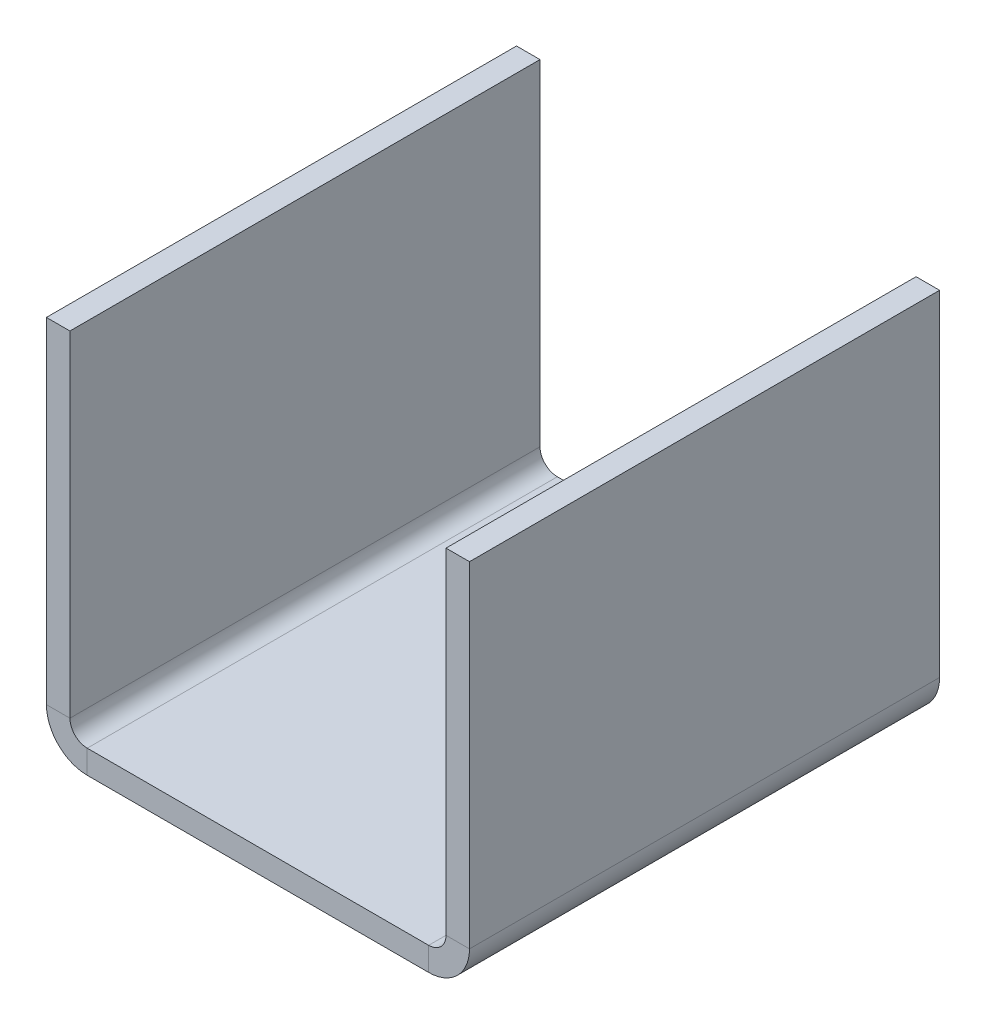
ISO-10303-21;
HEADER;
FILE_DESCRIPTION(('STEP AP214'),'2;1');
FILE_NAME('part.step','',(''),(''),'','','');
FILE_SCHEMA(('AUTOMOTIVE_DESIGN { 1 0 10303 214 1 1 1 1 }'));
ENDSEC;
DATA;
#1=APPLICATION_CONTEXT('core data for automotive mechanical design processes');
#2=APPLICATION_PROTOCOL_DEFINITION('international standard','automotive_design',2000,#1);
#3=PRODUCT_CONTEXT('',#1,'mechanical');
#4=PRODUCT('Part','Part','',(#3));
#5=PRODUCT_RELATED_PRODUCT_CATEGORY('part','',(#4));
#6=PRODUCT_DEFINITION_FORMATION('','',#4);
#7=PRODUCT_DEFINITION_CONTEXT('part definition',#1,'design');
#8=PRODUCT_DEFINITION('design','',#6,#7);
#9=PRODUCT_DEFINITION_SHAPE('','',#8);
#10=(LENGTH_UNIT() NAMED_UNIT(*) SI_UNIT(.MILLI.,.METRE.));
#11=(NAMED_UNIT(*) PLANE_ANGLE_UNIT() SI_UNIT($,.RADIAN.));
#12=(NAMED_UNIT(*) SI_UNIT($,.STERADIAN.) SOLID_ANGLE_UNIT());
#13=UNCERTAINTY_MEASURE_WITH_UNIT(LENGTH_MEASURE(1.E-05),#10,'distance_accuracy_value','');
#14=(GEOMETRIC_REPRESENTATION_CONTEXT(3) GLOBAL_UNCERTAINTY_ASSIGNED_CONTEXT((#13)) GLOBAL_UNIT_ASSIGNED_CONTEXT((#10,
#11,#12)) REPRESENTATION_CONTEXT('',''));
#15=CARTESIAN_POINT('',(0.,0.,0.));
#16=DIRECTION('',(0.,0.,1.));
#17=DIRECTION('',(1.,0.,0.));
#18=AXIS2_PLACEMENT_3D('',#15,#16,#17);
#19=CARTESIAN_POINT('',(33.0000000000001,-31.5268,-20.));
#20=DIRECTION('',(1.,0.,0.));
#21=DIRECTION('',(0.,0.,-1.));
#22=AXIS2_PLACEMENT_3D('',#19,#20,#21);
#23=PLANE('',#22);
#24=DIRECTION('',(0.,0.,1.));
#25=VECTOR('',#24,1.);
#26=CARTESIAN_POINT('',(32.9999999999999,16.0031999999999,-20.));
#27=LINE('',#26,#25);
#28=CARTESIAN_POINT('',(32.9999999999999,16.0031999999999,-20.));
#29=VERTEX_POINT('',#28);
#30=CARTESIAN_POINT('',(32.9999999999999,16.0031999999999,0.));
#31=VERTEX_POINT('',#30);
#32=EDGE_CURVE('E129',#29,#31,#27,.T.);
#33=ORIENTED_EDGE('',*,*,#32,.F.);
#34=DIRECTION('',(0.,-1.,0.));
#35=VECTOR('',#34,1.);
#36=CARTESIAN_POINT('',(33.0000000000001,-31.5268,-20.));
#37=LINE('',#36,#35);
#38=CARTESIAN_POINT('',(33.0000000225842,1.7366,-20.));
#39=VERTEX_POINT('',#38);
#40=EDGE_CURVE('E149',#29,#39,#37,.T.);
#41=ORIENTED_EDGE('',*,*,#40,.T.);
#42=DIRECTION('',(0.,0.,-1.));
#43=VECTOR('',#42,1.);
#44=CARTESIAN_POINT('',(33.,1.7366,-20.));
#45=LINE('',#44,#43);
#46=CARTESIAN_POINT('',(33.,1.7366,0.));
#47=VERTEX_POINT('',#46);
#48=EDGE_CURVE('E148',#47,#39,#45,.T.);
#49=ORIENTED_EDGE('',*,*,#48,.F.);
#50=DIRECTION('',(0.,1.,0.));
#51=VECTOR('',#50,1.);
#52=CARTESIAN_POINT('',(33.0000000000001,-31.5268,0.));
#53=LINE('',#52,#51);
#54=EDGE_CURVE('E143',#47,#31,#53,.T.);
#55=ORIENTED_EDGE('',*,*,#54,.T.);
#56=EDGE_LOOP('',(#33,#41,#49,#55));
#57=FACE_BOUND('',#56,.T.);
#58=ADVANCED_FACE('F40',(#57),#23,.F.);
#59=CARTESIAN_POINT('',(33.0000000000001,-31.5268,0.));
#60=DIRECTION('',(0.,0.,-1.));
#61=DIRECTION('',(0.,-1.,0.));
#62=AXIS2_PLACEMENT_3D('',#59,#60,#61);
#63=PLANE('',#62);
#64=DIRECTION('',(1.,0.,0.));
#65=VECTOR('',#64,1.);
#66=CARTESIAN_POINT('',(32.9999999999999,16.0031999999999,0.));
#67=LINE('',#66,#65);
#68=CARTESIAN_POINT('',(34.,16.0031999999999,0.));
#69=VERTEX_POINT('',#68);
#70=EDGE_CURVE('E132',#31,#69,#67,.T.);
#71=ORIENTED_EDGE('',*,*,#70,.F.);
#72=ORIENTED_EDGE('',*,*,#54,.F.);
#73=DIRECTION('',(-1.,0.,0.));
#74=VECTOR('',#73,1.);
#75=CARTESIAN_POINT('',(33.,1.7366,0.));
#76=LINE('',#75,#74);
#77=CARTESIAN_POINT('',(34.,1.73660000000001,0.));
#78=VERTEX_POINT('',#77);
#79=EDGE_CURVE('E150',#78,#47,#76,.T.);
#80=ORIENTED_EDGE('',*,*,#79,.F.);
#81=DIRECTION('',(0.,1.,0.));
#82=VECTOR('',#81,1.);
#83=CARTESIAN_POINT('',(34.0000000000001,-31.5268,0.));
#84=LINE('',#83,#82);
#85=EDGE_CURVE('E145',#78,#69,#84,.T.);
#86=ORIENTED_EDGE('',*,*,#85,.T.);
#87=EDGE_LOOP('',(#71,#72,#80,#86));
#88=FACE_BOUND('',#87,.T.);
#89=ADVANCED_FACE('F141',(#88),#63,.F.);
#90=CARTESIAN_POINT('',(34.0000000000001,-31.5268,-20.));
#91=DIRECTION('',(1.,0.,0.));
#92=DIRECTION('',(0.,0.,-1.));
#93=AXIS2_PLACEMENT_3D('',#90,#91,#92);
#94=PLANE('',#93);
#95=DIRECTION('',(0.,-1.,0.));
#96=VECTOR('',#95,1.);
#97=CARTESIAN_POINT('',(34.0000000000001,-31.5268,-20.));
#98=LINE('',#97,#96);
#99=CARTESIAN_POINT('',(34.,16.0031999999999,-20.));
#100=VERTEX_POINT('',#99);
#101=CARTESIAN_POINT('',(34.,1.73660000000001,-20.));
#102=VERTEX_POINT('',#101);
#103=EDGE_CURVE('E167',#100,#102,#98,.T.);
#104=ORIENTED_EDGE('',*,*,#103,.F.);
#105=DIRECTION('',(0.,0.,-1.));
#106=VECTOR('',#105,1.);
#107=CARTESIAN_POINT('',(34.,16.0031999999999,0.));
#108=LINE('',#107,#106);
#109=EDGE_CURVE('E57',#69,#100,#108,.T.);
#110=ORIENTED_EDGE('',*,*,#109,.F.);
#111=ORIENTED_EDGE('',*,*,#85,.F.);
#112=DIRECTION('',(0.,0.,-1.));
#113=VECTOR('',#112,1.);
#114=CARTESIAN_POINT('',(34.,1.73660000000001,-20.));
#115=LINE('',#114,#113);
#116=EDGE_CURVE('E249',#78,#102,#115,.T.);
#117=ORIENTED_EDGE('',*,*,#116,.T.);
#118=EDGE_LOOP('',(#104,#110,#111,#117));
#119=FACE_BOUND('',#118,.T.);
#120=ADVANCED_FACE('F312',(#119),#94,.T.);
#121=CARTESIAN_POINT('',(33.0000000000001,-31.5268,-20.));
#122=DIRECTION('',(0.,0.,1.));
#123=DIRECTION('',(0.,1.,0.));
#124=AXIS2_PLACEMENT_3D('',#121,#122,#123);
#125=PLANE('',#124);
#126=DIRECTION('',(-1.,0.,0.));
#127=VECTOR('',#126,1.);
#128=CARTESIAN_POINT('',(34.,16.0031999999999,-20.));
#129=LINE('',#128,#127);
#130=EDGE_CURVE('E133',#100,#29,#129,.T.);
#131=ORIENTED_EDGE('',*,*,#130,.F.);
#132=ORIENTED_EDGE('',*,*,#103,.T.);
#133=DIRECTION('',(1.,0.,0.));
#134=VECTOR('',#133,1.);
#135=CARTESIAN_POINT('',(33.,1.7366,-20.));
#136=LINE('',#135,#134);
#137=EDGE_CURVE('E153',#39,#102,#136,.T.);
#138=ORIENTED_EDGE('',*,*,#137,.F.);
#139=ORIENTED_EDGE('',*,*,#40,.F.);
#140=EDGE_LOOP('',(#131,#132,#138,#139));
#141=FACE_BOUND('',#140,.T.);
#142=ADVANCED_FACE('F319',(#141),#125,.F.);
#143=CARTESIAN_POINT('',(0.,1.,-20.));
#144=DIRECTION('',(0.,-1.,0.));
#145=DIRECTION('',(0.,0.,-1.));
#146=AXIS2_PLACEMENT_3D('',#143,#144,#145);
#147=PLANE('',#146);
#148=DIRECTION('',(1.,0.,0.));
#149=VECTOR('',#148,1.);
#150=CARTESIAN_POINT('',(0.,1.,0.));
#151=LINE('',#150,#149);
#152=CARTESIAN_POINT('',(17.7366,1.00000000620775,0.));
#153=VERTEX_POINT('',#152);
#154=CARTESIAN_POINT('',(32.2634,0.999999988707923,0.));
#155=VERTEX_POINT('',#154);
#156=EDGE_CURVE('E44',#153,#155,#151,.T.);
#157=ORIENTED_EDGE('',*,*,#156,.T.);
#158=DIRECTION('',(0.,0.,-1.));
#159=VECTOR('',#158,1.);
#160=CARTESIAN_POINT('',(32.2634,1.,-20.));
#161=LINE('',#160,#159);
#162=CARTESIAN_POINT('',(32.2634,0.999999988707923,-20.));
#163=VERTEX_POINT('',#162);
#164=EDGE_CURVE('E220',#155,#163,#161,.T.);
#165=ORIENTED_EDGE('',*,*,#164,.T.);
#166=DIRECTION('',(-1.,0.,0.));
#167=VECTOR('',#166,1.);
#168=CARTESIAN_POINT('',(0.,1.,-20.));
#169=LINE('',#168,#167);
#170=CARTESIAN_POINT('',(17.7366,1.,-20.));
#171=VERTEX_POINT('',#170);
#172=EDGE_CURVE('E211',#163,#171,#169,.T.);
#173=ORIENTED_EDGE('',*,*,#172,.T.);
#174=DIRECTION('',(0.,0.,-1.));
#175=VECTOR('',#174,1.);
#176=CARTESIAN_POINT('',(17.7366,1.,-20.));
#177=LINE('',#176,#175);
#178=EDGE_CURVE('E207',#153,#171,#177,.T.);
#179=ORIENTED_EDGE('',*,*,#178,.F.);
#180=EDGE_LOOP('',(#157,#165,#173,#179));
#181=FACE_BOUND('',#180,.T.);
#182=ADVANCED_FACE('F235',(#181),#147,.F.);
#183=CARTESIAN_POINT('',(0.,1.,-20.));
#184=DIRECTION('',(0.,0.,1.));
#185=DIRECTION('',(1.,0.,0.));
#186=AXIS2_PLACEMENT_3D('',#183,#184,#185);
#187=PLANE('',#186);
#188=ORIENTED_EDGE('',*,*,#172,.F.);
#189=DIRECTION('',(0.,-1.,0.));
#190=VECTOR('',#189,1.);
#191=CARTESIAN_POINT('',(32.2634,1.,-20.));
#192=LINE('',#191,#190);
#193=CARTESIAN_POINT('',(32.2634,0.,-20.));
#194=VERTEX_POINT('',#193);
#195=EDGE_CURVE('E12',#163,#194,#192,.T.);
#196=ORIENTED_EDGE('',*,*,#195,.T.);
#197=DIRECTION('',(-1.,0.,0.));
#198=VECTOR('',#197,1.);
#199=CARTESIAN_POINT('',(0.,0.,-20.));
#200=LINE('',#199,#198);
#201=CARTESIAN_POINT('',(17.7366,0.,-20.));
#202=VERTEX_POINT('',#201);
#203=EDGE_CURVE('E227',#194,#202,#200,.T.);
#204=ORIENTED_EDGE('',*,*,#203,.T.);
#205=DIRECTION('',(0.,-1.,0.));
#206=VECTOR('',#205,1.);
#207=CARTESIAN_POINT('',(17.7366,1.,-20.));
#208=LINE('',#207,#206);
#209=EDGE_CURVE('E210',#171,#202,#208,.T.);
#210=ORIENTED_EDGE('',*,*,#209,.F.);
#211=EDGE_LOOP('',(#188,#196,#204,#210));
#212=FACE_BOUND('',#211,.T.);
#213=ADVANCED_FACE('F42',(#212),#187,.F.);
#214=CARTESIAN_POINT('',(0.,1.,0.));
#215=DIRECTION('',(0.,0.,-1.));
#216=DIRECTION('',(-1.,0.,0.));
#217=AXIS2_PLACEMENT_3D('',#214,#215,#216);
#218=PLANE('',#217);
#219=DIRECTION('',(1.,0.,0.));
#220=VECTOR('',#219,1.);
#221=CARTESIAN_POINT('',(0.,0.,0.));
#222=LINE('',#221,#220);
#223=CARTESIAN_POINT('',(17.7366,0.,0.));
#224=VERTEX_POINT('',#223);
#225=CARTESIAN_POINT('',(32.2634,-2.25841554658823E-08,0.));
#226=VERTEX_POINT('',#225);
#227=EDGE_CURVE('E206',#224,#226,#222,.T.);
#228=ORIENTED_EDGE('',*,*,#227,.T.);
#229=DIRECTION('',(0.,1.,0.));
#230=VECTOR('',#229,1.);
#231=CARTESIAN_POINT('',(32.2634,1.,0.));
#232=LINE('',#231,#230);
#233=EDGE_CURVE('E223',#226,#155,#232,.T.);
#234=ORIENTED_EDGE('',*,*,#233,.T.);
#235=ORIENTED_EDGE('',*,*,#156,.F.);
#236=DIRECTION('',(0.,1.,0.));
#237=VECTOR('',#236,1.);
#238=CARTESIAN_POINT('',(17.7366,1.,0.));
#239=LINE('',#238,#237);
#240=EDGE_CURVE('E217',#224,#153,#239,.T.);
#241=ORIENTED_EDGE('',*,*,#240,.F.);
#242=EDGE_LOOP('',(#228,#234,#235,#241));
#243=FACE_BOUND('',#242,.T.);
#244=ADVANCED_FACE('F239',(#243),#218,.F.);
#245=CARTESIAN_POINT('',(0.,0.,-20.));
#246=DIRECTION('',(0.,-1.,0.));
#247=DIRECTION('',(0.,0.,-1.));
#248=AXIS2_PLACEMENT_3D('',#245,#246,#247);
#249=PLANE('',#248);
#250=DIRECTION('',(0.,0.,-1.));
#251=VECTOR('',#250,1.);
#252=CARTESIAN_POINT('',(32.2634,0.,-20.));
#253=LINE('',#252,#251);
#254=EDGE_CURVE('E49',#226,#194,#253,.T.);
#255=ORIENTED_EDGE('',*,*,#254,.F.);
#256=ORIENTED_EDGE('',*,*,#227,.F.);
#257=DIRECTION('',(0.,0.,-1.));
#258=VECTOR('',#257,1.);
#259=CARTESIAN_POINT('',(17.7366,0.,-20.));
#260=LINE('',#259,#258);
#261=EDGE_CURVE('E214',#224,#202,#260,.T.);
#262=ORIENTED_EDGE('',*,*,#261,.T.);
#263=ORIENTED_EDGE('',*,*,#203,.F.);
#264=EDGE_LOOP('',(#255,#256,#262,#263));
#265=FACE_BOUND('',#264,.T.);
#266=ADVANCED_FACE('F289',(#265),#249,.T.);
#267=CARTESIAN_POINT('',(17.7366,1.7365999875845,0.));
#268=DIRECTION('',(0.,0.,-1.));
#269=DIRECTION('',(-1.,0.,0.));
#270=AXIS2_PLACEMENT_3D('',#267,#268,#269);
#271=PLANE('',#270);
#272=DIRECTION('',(1.,0.,0.));
#273=VECTOR('',#272,1.);
#274=CARTESIAN_POINT('',(17.,1.7366,0.));
#275=LINE('',#274,#273);
#276=CARTESIAN_POINT('',(16.,1.7366,0.));
#277=VERTEX_POINT('',#276);
#278=CARTESIAN_POINT('',(17.0000000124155,1.7366,0.));
#279=VERTEX_POINT('',#278);
#280=EDGE_CURVE('E174',#277,#279,#275,.T.);
#281=ORIENTED_EDGE('',*,*,#280,.F.);
#282=CARTESIAN_POINT('',(17.7366,1.7366,0.));
#283=DIRECTION('',(0.,0.,1.));
#284=DIRECTION('',(1.,0.,0.));
#285=AXIS2_PLACEMENT_3D('',#282,#283,#284);
#286=CIRCLE('',#285,1.7365999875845);
#287=EDGE_CURVE('E177',#277,#224,#286,.T.);
#288=ORIENTED_EDGE('',*,*,#287,.T.);
#289=ORIENTED_EDGE('',*,*,#240,.T.);
#290=CARTESIAN_POINT('',(17.7366,1.7365999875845,0.));
#291=DIRECTION('',(0.,0.,1.));
#292=DIRECTION('',(1.,0.,0.));
#293=AXIS2_PLACEMENT_3D('',#290,#291,#292);
#294=CIRCLE('',#293,0.736599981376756);
#295=EDGE_CURVE('E200',#279,#153,#294,.T.);
#296=ORIENTED_EDGE('',*,*,#295,.F.);
#297=EDGE_LOOP('',(#281,#288,#289,#296));
#298=FACE_BOUND('',#297,.T.);
#299=ADVANCED_FACE('F282',(#298),#271,.F.);
#300=CARTESIAN_POINT('',(17.7366,1.7365999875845,-20.));
#301=DIRECTION('',(0.,0.,1.));
#302=DIRECTION('',(1.,0.,0.));
#303=AXIS2_PLACEMENT_3D('',#300,#301,#302);
#304=PLANE('',#303);
#305=CARTESIAN_POINT('',(17.7366,1.7366,-20.));
#306=DIRECTION('',(0.,0.,1.));
#307=DIRECTION('',(1.,0.,0.));
#308=AXIS2_PLACEMENT_3D('',#305,#306,#307);
#309=CIRCLE('',#308,1.7365999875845);
#310=CARTESIAN_POINT('',(16.,1.7366,-20.));
#311=VERTEX_POINT('',#310);
#312=EDGE_CURVE('E197',#202,#311,#309,.F.);
#313=ORIENTED_EDGE('',*,*,#312,.T.);
#314=DIRECTION('',(-1.,0.,0.));
#315=VECTOR('',#314,1.);
#316=CARTESIAN_POINT('',(17.,1.7366,-20.));
#317=LINE('',#316,#315);
#318=CARTESIAN_POINT('',(17.,1.7366,-20.));
#319=VERTEX_POINT('',#318);
#320=EDGE_CURVE('E183',#319,#311,#317,.T.);
#321=ORIENTED_EDGE('',*,*,#320,.F.);
#322=CARTESIAN_POINT('',(17.7366,1.7365999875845,-20.));
#323=DIRECTION('',(0.,0.,-1.));
#324=DIRECTION('',(-1.,0.,0.));
#325=AXIS2_PLACEMENT_3D('',#322,#323,#324);
#326=CIRCLE('',#325,0.736599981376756);
#327=EDGE_CURVE('E203',#171,#319,#326,.T.);
#328=ORIENTED_EDGE('',*,*,#327,.F.);
#329=ORIENTED_EDGE('',*,*,#209,.T.);
#330=EDGE_LOOP('',(#313,#321,#328,#329));
#331=FACE_BOUND('',#330,.T.);
#332=ADVANCED_FACE('F291',(#331),#304,.F.);
#333=CARTESIAN_POINT('',(17.7366,1.7366,-30.0499376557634));
#334=DIRECTION('',(0.,0.,1.));
#335=DIRECTION('',(1.,0.,0.));
#336=AXIS2_PLACEMENT_3D('',#333,#334,#335);
#337=CYLINDRICAL_SURFACE('',#336,0.736599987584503);
#338=ORIENTED_EDGE('',*,*,#178,.T.);
#339=ORIENTED_EDGE('',*,*,#327,.T.);
#340=DIRECTION('',(0.,0.,-1.));
#341=VECTOR('',#340,1.);
#342=CARTESIAN_POINT('',(17.,1.7366,-20.));
#343=LINE('',#342,#341);
#344=EDGE_CURVE('E189',#279,#319,#343,.T.);
#345=ORIENTED_EDGE('',*,*,#344,.F.);
#346=ORIENTED_EDGE('',*,*,#295,.T.);
#347=EDGE_LOOP('',(#338,#339,#345,#346));
#348=FACE_BOUND('',#347,.T.);
#349=ADVANCED_FACE('F280',(#348),#337,.F.);
#350=CARTESIAN_POINT('',(17.7366,1.7366,-30.0499376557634));
#351=DIRECTION('',(0.,0.,1.));
#352=DIRECTION('',(1.,0.,0.));
#353=AXIS2_PLACEMENT_3D('',#350,#351,#352);
#354=CYLINDRICAL_SURFACE('',#353,1.7365999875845);
#355=ORIENTED_EDGE('',*,*,#261,.F.);
#356=ORIENTED_EDGE('',*,*,#287,.F.);
#357=DIRECTION('',(0.,0.,-1.));
#358=VECTOR('',#357,1.);
#359=CARTESIAN_POINT('',(16.,1.7366,-20.));
#360=LINE('',#359,#358);
#361=EDGE_CURVE('E173',#277,#311,#360,.T.);
#362=ORIENTED_EDGE('',*,*,#361,.T.);
#363=ORIENTED_EDGE('',*,*,#312,.F.);
#364=EDGE_LOOP('',(#355,#356,#362,#363));
#365=FACE_BOUND('',#364,.T.);
#366=ADVANCED_FACE('F286',(#365),#354,.T.);
#367=CARTESIAN_POINT('',(17.0000000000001,18.4732,-20.));
#368=DIRECTION('',(-1.,0.,0.));
#369=DIRECTION('',(0.,0.,-1.));
#370=AXIS2_PLACEMENT_3D('',#367,#368,#369);
#371=PLANE('',#370);
#372=DIRECTION('',(0.,1.,0.));
#373=VECTOR('',#372,1.);
#374=CARTESIAN_POINT('',(17.0000000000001,18.4732,-20.));
#375=LINE('',#374,#373);
#376=CARTESIAN_POINT('',(17.,16.0032,-20.));
#377=VERTEX_POINT('',#376);
#378=EDGE_CURVE('E186',#319,#377,#375,.T.);
#379=ORIENTED_EDGE('',*,*,#378,.T.);
#380=DIRECTION('',(0.,0.,-1.));
#381=VECTOR('',#380,1.);
#382=CARTESIAN_POINT('',(17.,16.0032,-20.));
#383=LINE('',#382,#381);
#384=CARTESIAN_POINT('',(17.,16.0032,0.));
#385=VERTEX_POINT('',#384);
#386=EDGE_CURVE('E258',#385,#377,#383,.T.);
#387=ORIENTED_EDGE('',*,*,#386,.F.);
#388=DIRECTION('',(0.,-1.,0.));
#389=VECTOR('',#388,1.);
#390=CARTESIAN_POINT('',(17.0000000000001,18.4732,0.));
#391=LINE('',#390,#389);
#392=EDGE_CURVE('E191',#385,#279,#391,.T.);
#393=ORIENTED_EDGE('',*,*,#392,.T.);
#394=ORIENTED_EDGE('',*,*,#344,.T.);
#395=EDGE_LOOP('',(#379,#387,#393,#394));
#396=FACE_BOUND('',#395,.T.);
#397=ADVANCED_FACE('F270',(#396),#371,.F.);
#398=CARTESIAN_POINT('',(17.0000000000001,18.4732,-20.));
#399=DIRECTION('',(0.,0.,1.));
#400=DIRECTION('',(0.,-1.,0.));
#401=AXIS2_PLACEMENT_3D('',#398,#399,#400);
#402=PLANE('',#401);
#403=DIRECTION('',(0.,1.,0.));
#404=VECTOR('',#403,1.);
#405=CARTESIAN_POINT('',(16.0000000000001,18.4732,-20.));
#406=LINE('',#405,#404);
#407=CARTESIAN_POINT('',(16.,16.0032,-20.));
#408=VERTEX_POINT('',#407);
#409=EDGE_CURVE('E180',#311,#408,#406,.T.);
#410=ORIENTED_EDGE('',*,*,#409,.T.);
#411=DIRECTION('',(-1.,0.,0.));
#412=VECTOR('',#411,1.);
#413=CARTESIAN_POINT('',(16.,16.0032,-20.));
#414=LINE('',#413,#412);
#415=EDGE_CURVE('E256',#377,#408,#414,.T.);
#416=ORIENTED_EDGE('',*,*,#415,.F.);
#417=ORIENTED_EDGE('',*,*,#378,.F.);
#418=ORIENTED_EDGE('',*,*,#320,.T.);
#419=EDGE_LOOP('',(#410,#416,#417,#418));
#420=FACE_BOUND('',#419,.T.);
#421=ADVANCED_FACE('F353',(#420),#402,.F.);
#422=CARTESIAN_POINT('',(16.0000000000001,18.4732,-20.));
#423=DIRECTION('',(-1.,0.,0.));
#424=DIRECTION('',(0.,0.,-1.));
#425=AXIS2_PLACEMENT_3D('',#422,#423,#424);
#426=PLANE('',#425);
#427=DIRECTION('',(0.,0.,1.));
#428=VECTOR('',#427,1.);
#429=CARTESIAN_POINT('',(16.,16.0032,0.));
#430=LINE('',#429,#428);
#431=CARTESIAN_POINT('',(16.,16.0032,0.));
#432=VERTEX_POINT('',#431);
#433=EDGE_CURVE('E65',#408,#432,#430,.T.);
#434=ORIENTED_EDGE('',*,*,#433,.F.);
#435=ORIENTED_EDGE('',*,*,#409,.F.);
#436=ORIENTED_EDGE('',*,*,#361,.F.);
#437=DIRECTION('',(0.,-1.,0.));
#438=VECTOR('',#437,1.);
#439=CARTESIAN_POINT('',(16.0000000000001,18.4732,0.));
#440=LINE('',#439,#438);
#441=EDGE_CURVE('E178',#432,#277,#440,.T.);
#442=ORIENTED_EDGE('',*,*,#441,.F.);
#443=EDGE_LOOP('',(#434,#435,#436,#442));
#444=FACE_BOUND('',#443,.T.);
#445=ADVANCED_FACE('F350',(#444),#426,.T.);
#446=CARTESIAN_POINT('',(17.0000000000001,18.4732,0.));
#447=DIRECTION('',(0.,0.,-1.));
#448=DIRECTION('',(0.,1.,0.));
#449=AXIS2_PLACEMENT_3D('',#446,#447,#448);
#450=PLANE('',#449);
#451=ORIENTED_EDGE('',*,*,#392,.F.);
#452=DIRECTION('',(1.,0.,0.));
#453=VECTOR('',#452,1.);
#454=CARTESIAN_POINT('',(17.,16.0032,0.));
#455=LINE('',#454,#453);
#456=EDGE_CURVE('E260',#432,#385,#455,.T.);
#457=ORIENTED_EDGE('',*,*,#456,.F.);
#458=ORIENTED_EDGE('',*,*,#441,.T.);
#459=ORIENTED_EDGE('',*,*,#280,.T.);
#460=EDGE_LOOP('',(#451,#457,#458,#459));
#461=FACE_BOUND('',#460,.T.);
#462=ADVANCED_FACE('F272',(#461),#450,.F.);
#463=CARTESIAN_POINT('',(32.2634,1.73660002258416,0.));
#464=DIRECTION('',(0.,0.,-1.));
#465=DIRECTION('',(-1.,0.,0.));
#466=AXIS2_PLACEMENT_3D('',#463,#464,#465);
#467=PLANE('',#466);
#468=ORIENTED_EDGE('',*,*,#233,.F.);
#469=CARTESIAN_POINT('',(32.2634,1.7366,0.));
#470=DIRECTION('',(0.,0.,-1.));
#471=DIRECTION('',(-1.,0.,0.));
#472=AXIS2_PLACEMENT_3D('',#469,#470,#471);
#473=CIRCLE('',#472,1.73660002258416);
#474=EDGE_CURVE('E164',#226,#78,#473,.F.);
#475=ORIENTED_EDGE('',*,*,#474,.T.);
#476=ORIENTED_EDGE('',*,*,#79,.T.);
#477=CARTESIAN_POINT('',(32.2634,1.73660002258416,0.));
#478=DIRECTION('',(0.,0.,1.));
#479=DIRECTION('',(1.,0.,0.));
#480=AXIS2_PLACEMENT_3D('',#477,#478,#479);
#481=CIRCLE('',#480,0.736600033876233);
#482=EDGE_CURVE('E163',#155,#47,#481,.T.);
#483=ORIENTED_EDGE('',*,*,#482,.F.);
#484=EDGE_LOOP('',(#468,#475,#476,#483));
#485=FACE_BOUND('',#484,.T.);
#486=ADVANCED_FACE('F243',(#485),#467,.F.);
#487=CARTESIAN_POINT('',(32.2634,1.73660002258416,-20.));
#488=DIRECTION('',(0.,0.,1.));
#489=DIRECTION('',(1.,0.,0.));
#490=AXIS2_PLACEMENT_3D('',#487,#488,#489);
#491=PLANE('',#490);
#492=ORIENTED_EDGE('',*,*,#137,.T.);
#493=CARTESIAN_POINT('',(32.2634,1.7366,-20.));
#494=DIRECTION('',(0.,0.,-1.));
#495=DIRECTION('',(-1.,0.,0.));
#496=AXIS2_PLACEMENT_3D('',#493,#494,#495);
#497=CIRCLE('',#496,1.73660002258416);
#498=EDGE_CURVE('E160',#102,#194,#497,.T.);
#499=ORIENTED_EDGE('',*,*,#498,.T.);
#500=ORIENTED_EDGE('',*,*,#195,.F.);
#501=CARTESIAN_POINT('',(32.2634,1.73660002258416,-20.));
#502=DIRECTION('',(0.,0.,-1.));
#503=DIRECTION('',(-1.,0.,0.));
#504=AXIS2_PLACEMENT_3D('',#501,#502,#503);
#505=CIRCLE('',#504,0.736600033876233);
#506=EDGE_CURVE('E170',#39,#163,#505,.T.);
#507=ORIENTED_EDGE('',*,*,#506,.F.);
#508=EDGE_LOOP('',(#492,#499,#500,#507));
#509=FACE_BOUND('',#508,.T.);
#510=ADVANCED_FACE('F296',(#509),#491,.F.);
#511=CARTESIAN_POINT('',(32.2634,1.7366,10.0499376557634));
#512=DIRECTION('',(0.,0.,-1.));
#513=DIRECTION('',(-1.,0.,0.));
#514=AXIS2_PLACEMENT_3D('',#511,#512,#513);
#515=CYLINDRICAL_SURFACE('',#514,0.736600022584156);
#516=ORIENTED_EDGE('',*,*,#506,.T.);
#517=ORIENTED_EDGE('',*,*,#164,.F.);
#518=ORIENTED_EDGE('',*,*,#482,.T.);
#519=ORIENTED_EDGE('',*,*,#48,.T.);
#520=EDGE_LOOP('',(#516,#517,#518,#519));
#521=FACE_BOUND('',#520,.T.);
#522=ADVANCED_FACE('F298',(#521),#515,.F.);
#523=CARTESIAN_POINT('',(32.2634,1.7366,10.0499376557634));
#524=DIRECTION('',(0.,0.,-1.));
#525=DIRECTION('',(-1.,0.,0.));
#526=AXIS2_PLACEMENT_3D('',#523,#524,#525);
#527=CYLINDRICAL_SURFACE('',#526,1.73660002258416);
#528=ORIENTED_EDGE('',*,*,#498,.F.);
#529=ORIENTED_EDGE('',*,*,#116,.F.);
#530=ORIENTED_EDGE('',*,*,#474,.F.);
#531=ORIENTED_EDGE('',*,*,#254,.T.);
#532=EDGE_LOOP('',(#528,#529,#530,#531));
#533=FACE_BOUND('',#532,.T.);
#534=ADVANCED_FACE('F247',(#533),#527,.T.);
#535=CARTESIAN_POINT('',(16.,16.0032,0.));
#536=DIRECTION('',(0.,-1.,0.));
#537=DIRECTION('',(1.,0.,0.));
#538=AXIS2_PLACEMENT_3D('',#535,#536,#537);
#539=PLANE('',#538);
#540=ORIENTED_EDGE('',*,*,#456,.T.);
#541=ORIENTED_EDGE('',*,*,#386,.T.);
#542=ORIENTED_EDGE('',*,*,#415,.T.);
#543=ORIENTED_EDGE('',*,*,#433,.T.);
#544=EDGE_LOOP('',(#540,#541,#542,#543));
#545=FACE_BOUND('',#544,.T.);
#546=ADVANCED_FACE('F264',(#545),#539,.F.);
#547=CARTESIAN_POINT('',(32.9999999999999,16.0031999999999,0.));
#548=DIRECTION('',(0.,1.,0.));
#549=DIRECTION('',(-1.,0.,0.));
#550=AXIS2_PLACEMENT_3D('',#547,#548,#549);
#551=PLANE('',#550);
#552=ORIENTED_EDGE('',*,*,#32,.T.);
#553=ORIENTED_EDGE('',*,*,#70,.T.);
#554=ORIENTED_EDGE('',*,*,#109,.T.);
#555=ORIENTED_EDGE('',*,*,#130,.T.);
#556=EDGE_LOOP('',(#552,#553,#554,#555));
#557=FACE_BOUND('',#556,.T.);
#558=ADVANCED_FACE('F131',(#557),#551,.T.);
#559=CLOSED_SHELL('',(#58,#89,#120,#142,#182,#213,#244,#266,#299,#332,#349,#366,#397,#421,#445,
#462,#486,#510,#522,#534,#546,#558));
#560=MANIFOLD_SOLID_BREP('B2',#559);
#561=ADVANCED_BREP_SHAPE_REPRESENTATION('',(#18,#560),#14);
#562=SHAPE_DEFINITION_REPRESENTATION(#9,#561);
ENDSEC;
END-ISO-10303-21;
